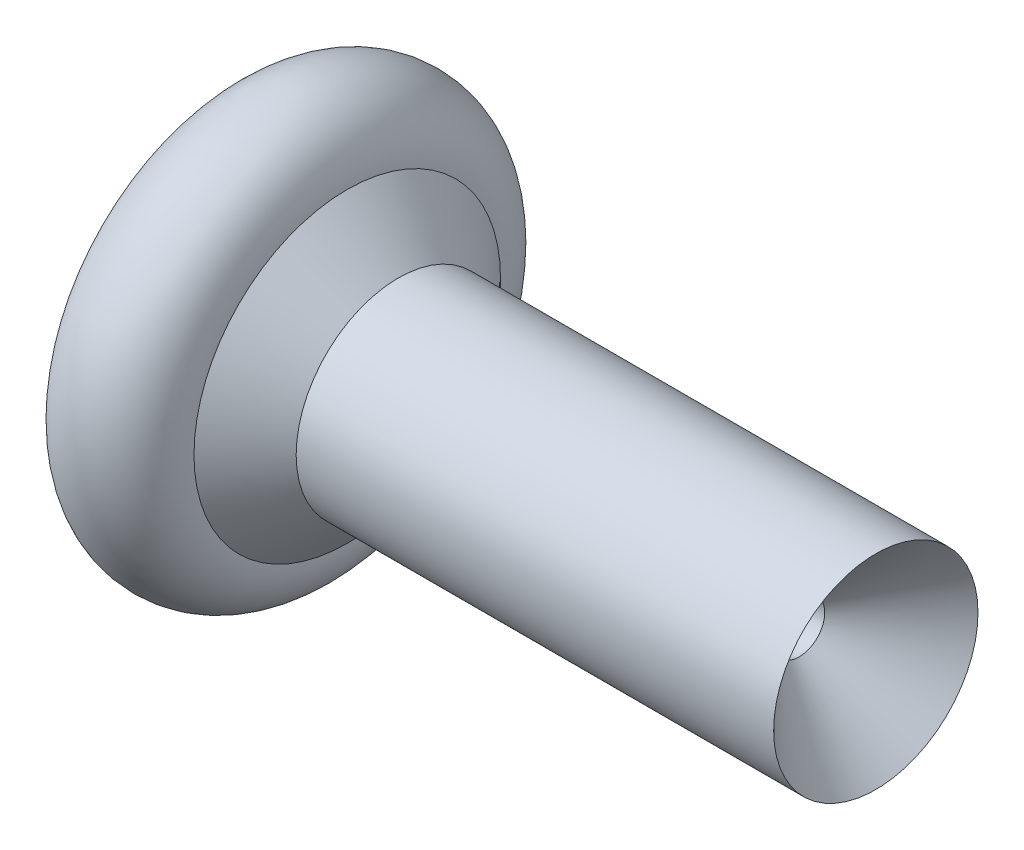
ISO-10303-21;
HEADER;
FILE_DESCRIPTION(('STEP AP214'),'2;1');
FILE_NAME('part.step','',(''),(''),'','','');
FILE_SCHEMA(('AUTOMOTIVE_DESIGN { 1 0 10303 214 1 1 1 1 }'));
ENDSEC;
DATA;
#1=APPLICATION_CONTEXT('core data for automotive mechanical design processes');
#2=APPLICATION_PROTOCOL_DEFINITION('international standard','automotive_design',2000,#1);
#3=PRODUCT_CONTEXT('',#1,'mechanical');
#4=PRODUCT('Part','Part','',(#3));
#5=PRODUCT_RELATED_PRODUCT_CATEGORY('part','',(#4));
#6=PRODUCT_DEFINITION_FORMATION('','',#4);
#7=PRODUCT_DEFINITION_CONTEXT('part definition',#1,'design');
#8=PRODUCT_DEFINITION('design','',#6,#7);
#9=PRODUCT_DEFINITION_SHAPE('','',#8);
#10=(LENGTH_UNIT() NAMED_UNIT(*) SI_UNIT(.MILLI.,.METRE.));
#11=(NAMED_UNIT(*) PLANE_ANGLE_UNIT() SI_UNIT($,.RADIAN.));
#12=(NAMED_UNIT(*) SI_UNIT($,.STERADIAN.) SOLID_ANGLE_UNIT());
#13=UNCERTAINTY_MEASURE_WITH_UNIT(LENGTH_MEASURE(1.E-05),#10,'distance_accuracy_value','');
#14=(GEOMETRIC_REPRESENTATION_CONTEXT(3) GLOBAL_UNCERTAINTY_ASSIGNED_CONTEXT((#13)) GLOBAL_UNIT_ASSIGNED_CONTEXT((#10,
#11,#12)) REPRESENTATION_CONTEXT('',''));
#15=CARTESIAN_POINT('',(0.,0.,0.));
#16=DIRECTION('',(0.,0.,1.));
#17=DIRECTION('',(1.,0.,0.));
#18=AXIS2_PLACEMENT_3D('',#15,#16,#17);
#19=CARTESIAN_POINT('',(0.,0.,0.));
#20=DIRECTION('',(-1.,0.,0.));
#21=DIRECTION('',(0.,0.,1.));
#22=AXIS2_PLACEMENT_3D('',#19,#20,#21);
#23=CYLINDRICAL_SURFACE('',#22,5.);
#24=CARTESIAN_POINT('',(112.474774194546,0.,0.));
#25=DIRECTION('',(-1.,0.,0.));
#26=DIRECTION('',(0.,0.,1.));
#27=AXIS2_PLACEMENT_3D('',#24,#25,#26);
#28=CIRCLE('',#27,5.);
#29=CARTESIAN_POINT('',(112.474774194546,0.,-5.00000000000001));
#30=VERTEX_POINT('',#29);
#31=EDGE_CURVE('E76',#30,#30,#28,.T.);
#32=ORIENTED_EDGE('',*,*,#31,.F.);
#33=EDGE_LOOP('',(#32));
#34=FACE_BOUND('',#33,.T.);
#35=CARTESIAN_POINT('',(82.4747741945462,0.,0.));
#36=DIRECTION('',(-1.,0.,0.));
#37=DIRECTION('',(0.,0.,1.));
#38=AXIS2_PLACEMENT_3D('',#35,#36,#37);
#39=CIRCLE('',#38,5.);
#40=CARTESIAN_POINT('',(82.4747741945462,0.,5.));
#41=VERTEX_POINT('',#40);
#42=EDGE_CURVE('E11',#41,#41,#39,.T.);
#43=ORIENTED_EDGE('',*,*,#42,.T.);
#44=EDGE_LOOP('',(#43));
#45=FACE_BOUND('',#44,.T.);
#46=ADVANCED_FACE('F33',(#34,#45),#23,.F.);
#47=CARTESIAN_POINT('',(82.4747741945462,0.,0.));
#48=DIRECTION('',(-1.,0.,0.));
#49=DIRECTION('',(0.,0.,1.));
#50=AXIS2_PLACEMENT_3D('',#47,#48,#49);
#51=PLANE('',#50);
#52=ORIENTED_EDGE('',*,*,#42,.F.);
#53=EDGE_LOOP('',(#52));
#54=FACE_BOUND('',#53,.T.);
#55=ADVANCED_FACE('F46',(#54),#51,.F.);
#56=CARTESIAN_POINT('',(35.,0.,0.));
#57=DIRECTION('',(-1.,0.,0.));
#58=DIRECTION('',(0.,0.,1.));
#59=AXIS2_PLACEMENT_3D('',#56,#57,#58);
#60=CONICAL_SURFACE('',#59,10.,0.349065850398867);
#61=CARTESIAN_POINT('',(62.4747741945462,0.,0.));
#62=VERTEX_POINT('',#61);
#63=VERTEX_LOOP('',#62);
#64=FACE_BOUND('',#63,.T.);
#65=CARTESIAN_POINT('',(35.,0.,0.));
#66=DIRECTION('',(-1.,0.,0.));
#67=DIRECTION('',(0.,0.,1.));
#68=AXIS2_PLACEMENT_3D('',#65,#66,#67);
#69=CIRCLE('',#68,10.);
#70=CARTESIAN_POINT('',(35.,0.,10.));
#71=VERTEX_POINT('',#70);
#72=EDGE_CURVE('E39',#71,#71,#69,.T.);
#73=ORIENTED_EDGE('',*,*,#72,.T.);
#74=EDGE_LOOP('',(#73));
#75=FACE_BOUND('',#74,.T.);
#76=ADVANCED_FACE('F42',(#64,#75),#60,.F.);
#77=CARTESIAN_POINT('',(35.,0.,-5.));
#78=DIRECTION('',(-1.,0.,0.));
#79=DIRECTION('',(0.,0.,1.));
#80=AXIS2_PLACEMENT_3D('',#77,#78,#79);
#81=PLANE('',#80);
#82=ORIENTED_EDGE('',*,*,#72,.F.);
#83=EDGE_LOOP('',(#82));
#84=FACE_BOUND('',#83,.T.);
#85=CARTESIAN_POINT('',(35.,0.,0.));
#86=DIRECTION('',(-1.,0.,0.));
#87=DIRECTION('',(0.,0.,1.));
#88=AXIS2_PLACEMENT_3D('',#85,#86,#87);
#89=CIRCLE('',#88,5.);
#90=CARTESIAN_POINT('',(35.,0.,5.));
#91=VERTEX_POINT('',#90);
#92=EDGE_CURVE('E51',#91,#91,#89,.T.);
#93=ORIENTED_EDGE('',*,*,#92,.T.);
#94=EDGE_LOOP('',(#93));
#95=FACE_BOUND('',#94,.T.);
#96=ADVANCED_FACE('F45',(#84,#95),#81,.F.);
#97=CARTESIAN_POINT('',(0.,0.,0.));
#98=DIRECTION('',(-1.,0.,0.));
#99=DIRECTION('',(0.,0.,1.));
#100=AXIS2_PLACEMENT_3D('',#97,#98,#99);
#101=CYLINDRICAL_SURFACE('',#100,5.);
#102=ORIENTED_EDGE('',*,*,#92,.F.);
#103=EDGE_LOOP('',(#102));
#104=FACE_BOUND('',#103,.T.);
#105=CARTESIAN_POINT('',(20.,0.,0.));
#106=DIRECTION('',(-1.,0.,0.));
#107=DIRECTION('',(0.,0.,1.));
#108=AXIS2_PLACEMENT_3D('',#105,#106,#107);
#109=CIRCLE('',#108,5.);
#110=CARTESIAN_POINT('',(20.,0.,5.));
#111=VERTEX_POINT('',#110);
#112=EDGE_CURVE('E53',#111,#111,#109,.T.);
#113=ORIENTED_EDGE('',*,*,#112,.T.);
#114=EDGE_LOOP('',(#113));
#115=FACE_BOUND('',#114,.T.);
#116=ADVANCED_FACE('F92',(#104,#115),#101,.F.);
#117=CARTESIAN_POINT('',(20.,0.,-15.));
#118=DIRECTION('',(1.,0.,0.));
#119=DIRECTION('',(0.,0.,-1.));
#120=AXIS2_PLACEMENT_3D('',#117,#118,#119);
#121=PLANE('',#120);
#122=ORIENTED_EDGE('',*,*,#112,.F.);
#123=EDGE_LOOP('',(#122));
#124=FACE_BOUND('',#123,.T.);
#125=CARTESIAN_POINT('',(20.,0.,0.));
#126=DIRECTION('',(-1.,0.,0.));
#127=DIRECTION('',(0.,0.,1.));
#128=AXIS2_PLACEMENT_3D('',#125,#126,#127);
#129=CIRCLE('',#128,15.);
#130=CARTESIAN_POINT('',(20.,0.,15.));
#131=VERTEX_POINT('',#130);
#132=EDGE_CURVE('E58',#131,#131,#129,.T.);
#133=ORIENTED_EDGE('',*,*,#132,.T.);
#134=EDGE_LOOP('',(#133));
#135=FACE_BOUND('',#134,.T.);
#136=ADVANCED_FACE('F95',(#124,#135),#121,.F.);
#137=CARTESIAN_POINT('',(0.,0.,0.));
#138=DIRECTION('',(-1.,0.,0.));
#139=DIRECTION('',(0.,0.,1.));
#140=AXIS2_PLACEMENT_3D('',#137,#138,#139);
#141=CYLINDRICAL_SURFACE('',#140,15.);
#142=ORIENTED_EDGE('',*,*,#132,.F.);
#143=EDGE_LOOP('',(#142));
#144=FACE_BOUND('',#143,.T.);
#145=CARTESIAN_POINT('',(0.,0.,0.));
#146=DIRECTION('',(-1.,0.,0.));
#147=DIRECTION('',(0.,0.,1.));
#148=AXIS2_PLACEMENT_3D('',#145,#146,#147);
#149=CIRCLE('',#148,15.);
#150=CARTESIAN_POINT('',(0.,0.,15.));
#151=VERTEX_POINT('',#150);
#152=EDGE_CURVE('E61',#151,#151,#149,.T.);
#153=ORIENTED_EDGE('',*,*,#152,.T.);
#154=EDGE_LOOP('',(#153));
#155=FACE_BOUND('',#154,.T.);
#156=ADVANCED_FACE('F99',(#144,#155),#141,.F.);
#157=CARTESIAN_POINT('',(0.,0.,-15.));
#158=DIRECTION('',(1.,0.,0.));
#159=DIRECTION('',(0.,0.,-1.));
#160=AXIS2_PLACEMENT_3D('',#157,#158,#159);
#161=PLANE('',#160);
#162=ORIENTED_EDGE('',*,*,#152,.F.);
#163=EDGE_LOOP('',(#162));
#164=FACE_BOUND('',#163,.T.);
#165=CARTESIAN_POINT('',(0.,0.,0.));
#166=DIRECTION('',(-1.,0.,0.));
#167=DIRECTION('',(0.,0.,1.));
#168=AXIS2_PLACEMENT_3D('',#165,#166,#167);
#169=CIRCLE('',#168,30.);
#170=CARTESIAN_POINT('',(0.,0.,30.));
#171=VERTEX_POINT('',#170);
#172=EDGE_CURVE('E64',#171,#171,#169,.T.);
#173=ORIENTED_EDGE('',*,*,#172,.T.);
#174=EDGE_LOOP('',(#173));
#175=FACE_BOUND('',#174,.T.);
#176=ADVANCED_FACE('F103',(#164,#175),#161,.F.);
#177=CARTESIAN_POINT('',(12.,0.,0.));
#178=DIRECTION('',(-1.,0.,0.));
#179=DIRECTION('',(0.,0.,1.));
#180=AXIS2_PLACEMENT_3D('',#177,#178,#179);
#181=TOROIDAL_SURFACE('',#180,30.,12.);
#182=ORIENTED_EDGE('',*,*,#172,.F.);
#183=EDGE_LOOP('',(#182));
#184=FACE_BOUND('',#183,.T.);
#185=CARTESIAN_POINT('',(24.,0.,0.));
#186=DIRECTION('',(-1.,0.,0.));
#187=DIRECTION('',(0.,0.,1.));
#188=AXIS2_PLACEMENT_3D('',#185,#186,#187);
#189=CIRCLE('',#188,30.);
#190=CARTESIAN_POINT('',(24.,0.,30.));
#191=VERTEX_POINT('',#190);
#192=EDGE_CURVE('E67',#191,#191,#189,.T.);
#193=ORIENTED_EDGE('',*,*,#192,.T.);
#194=EDGE_LOOP('',(#193));
#195=FACE_BOUND('',#194,.T.);
#196=ADVANCED_FACE('F107',(#184,#195),#181,.T.);
#197=CARTESIAN_POINT('',(34.,0.,0.));
#198=DIRECTION('',(-1.,0.,0.));
#199=DIRECTION('',(0.,0.,1.));
#200=AXIS2_PLACEMENT_3D('',#197,#198,#199);
#201=CONICAL_SURFACE('',#200,20.,0.78539816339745);
#202=ORIENTED_EDGE('',*,*,#192,.F.);
#203=EDGE_LOOP('',(#202));
#204=FACE_BOUND('',#203,.T.);
#205=CARTESIAN_POINT('',(34.,0.,0.));
#206=DIRECTION('',(-1.,0.,0.));
#207=DIRECTION('',(0.,0.,1.));
#208=AXIS2_PLACEMENT_3D('',#205,#206,#207);
#209=CIRCLE('',#208,20.);
#210=CARTESIAN_POINT('',(34.,0.,20.));
#211=VERTEX_POINT('',#210);
#212=EDGE_CURVE('E70',#211,#211,#209,.T.);
#213=ORIENTED_EDGE('',*,*,#212,.T.);
#214=EDGE_LOOP('',(#213));
#215=FACE_BOUND('',#214,.T.);
#216=ADVANCED_FACE('F111',(#204,#215),#201,.T.);
#217=CARTESIAN_POINT('',(0.,0.,0.));
#218=DIRECTION('',(-1.,0.,0.));
#219=DIRECTION('',(0.,0.,1.));
#220=AXIS2_PLACEMENT_3D('',#217,#218,#219);
#221=CYLINDRICAL_SURFACE('',#220,20.);
#222=ORIENTED_EDGE('',*,*,#212,.F.);
#223=EDGE_LOOP('',(#222));
#224=FACE_BOUND('',#223,.T.);
#225=CARTESIAN_POINT('',(127.474774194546,0.,0.));
#226=DIRECTION('',(-1.,0.,0.));
#227=DIRECTION('',(0.,0.,1.));
#228=AXIS2_PLACEMENT_3D('',#225,#226,#227);
#229=CIRCLE('',#228,20.);
#230=CARTESIAN_POINT('',(127.474774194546,0.,-20.));
#231=VERTEX_POINT('',#230);
#232=EDGE_CURVE('E73',#231,#231,#229,.T.);
#233=ORIENTED_EDGE('',*,*,#232,.T.);
#234=EDGE_LOOP('',(#233));
#235=FACE_BOUND('',#234,.T.);
#236=ADVANCED_FACE('F115',(#224,#235),#221,.T.);
#237=CARTESIAN_POINT('',(112.474774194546,0.,0.));
#238=DIRECTION('',(1.,0.,0.));
#239=DIRECTION('',(0.,0.,-1.));
#240=AXIS2_PLACEMENT_3D('',#237,#238,#239);
#241=CONICAL_SURFACE('',#240,5.,0.785398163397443);
#242=CARTESIAN_POINT('',(127.474774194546,0.,-20.));
#243=CARTESIAN_POINT('',(127.318524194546,0.,-19.84375));
#244=CARTESIAN_POINT('',(127.162274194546,0.,-19.6875));
#245=CARTESIAN_POINT('',(126.849774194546,0.,-19.375));
#246=CARTESIAN_POINT('',(126.693524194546,0.,-19.21875));
#247=CARTESIAN_POINT('',(126.381024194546,0.,-18.90625));
#248=CARTESIAN_POINT('',(126.224774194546,0.,-18.75));
#249=CARTESIAN_POINT('',(125.912274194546,0.,-18.4375));
#250=CARTESIAN_POINT('',(125.756024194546,0.,-18.28125));
#251=CARTESIAN_POINT('',(125.443524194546,0.,-17.96875));
#252=CARTESIAN_POINT('',(125.287274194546,0.,-17.8125));
#253=CARTESIAN_POINT('',(124.974774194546,0.,-17.5));
#254=CARTESIAN_POINT('',(124.818524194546,0.,-17.34375));
#255=CARTESIAN_POINT('',(124.506024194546,0.,-17.03125));
#256=CARTESIAN_POINT('',(124.349774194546,0.,-16.875));
#257=CARTESIAN_POINT('',(124.037274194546,0.,-16.5625));
#258=CARTESIAN_POINT('',(123.881024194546,0.,-16.40625));
#259=CARTESIAN_POINT('',(123.568524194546,0.,-16.09375));
#260=CARTESIAN_POINT('',(123.412274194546,0.,-15.9375));
#261=CARTESIAN_POINT('',(123.099774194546,0.,-15.625));
#262=CARTESIAN_POINT('',(122.943524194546,0.,-15.46875));
#263=CARTESIAN_POINT('',(122.631024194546,0.,-15.15625));
#264=CARTESIAN_POINT('',(122.474774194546,0.,-15.));
#265=CARTESIAN_POINT('',(122.162274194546,0.,-14.6875));
#266=CARTESIAN_POINT('',(122.006024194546,0.,-14.53125));
#267=CARTESIAN_POINT('',(121.693524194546,0.,-14.21875));
#268=CARTESIAN_POINT('',(121.537274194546,0.,-14.0625));
#269=CARTESIAN_POINT('',(121.224774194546,0.,-13.75));
#270=CARTESIAN_POINT('',(121.068524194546,0.,-13.59375));
#271=CARTESIAN_POINT('',(120.756024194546,0.,-13.28125));
#272=CARTESIAN_POINT('',(120.599774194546,0.,-13.125));
#273=CARTESIAN_POINT('',(120.287274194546,0.,-12.8125));
#274=CARTESIAN_POINT('',(120.131024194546,0.,-12.65625));
#275=CARTESIAN_POINT('',(119.818524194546,0.,-12.34375));
#276=CARTESIAN_POINT('',(119.662274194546,0.,-12.1875));
#277=CARTESIAN_POINT('',(119.349774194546,0.,-11.875));
#278=CARTESIAN_POINT('',(119.193524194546,0.,-11.71875));
#279=CARTESIAN_POINT('',(118.881024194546,0.,-11.40625));
#280=CARTESIAN_POINT('',(118.724774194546,0.,-11.25));
#281=CARTESIAN_POINT('',(118.412274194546,0.,-10.9375));
#282=CARTESIAN_POINT('',(118.256024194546,0.,-10.78125));
#283=CARTESIAN_POINT('',(117.943524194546,0.,-10.46875));
#284=CARTESIAN_POINT('',(117.787274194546,0.,-10.3125));
#285=CARTESIAN_POINT('',(117.474774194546,0.,-10.));
#286=CARTESIAN_POINT('',(117.318524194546,0.,-9.84375000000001));
#287=CARTESIAN_POINT('',(117.006024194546,0.,-9.53125000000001));
#288=CARTESIAN_POINT('',(116.849774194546,0.,-9.37500000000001));
#289=CARTESIAN_POINT('',(116.537274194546,0.,-9.06250000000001));
#290=CARTESIAN_POINT('',(116.381024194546,0.,-8.90625));
#291=CARTESIAN_POINT('',(116.068524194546,0.,-8.59375));
#292=CARTESIAN_POINT('',(115.912274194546,0.,-8.4375));
#293=CARTESIAN_POINT('',(115.599774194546,0.,-8.12500000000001));
#294=CARTESIAN_POINT('',(115.443524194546,0.,-7.96875000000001));
#295=CARTESIAN_POINT('',(115.131024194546,0.,-7.65625000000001));
#296=CARTESIAN_POINT('',(114.974774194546,0.,-7.50000000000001));
#297=CARTESIAN_POINT('',(114.662274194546,0.,-7.18750000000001));
#298=CARTESIAN_POINT('',(114.506024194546,0.,-7.03125000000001));
#299=CARTESIAN_POINT('',(114.193524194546,0.,-6.71875000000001));
#300=CARTESIAN_POINT('',(114.037274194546,0.,-6.56250000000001));
#301=CARTESIAN_POINT('',(113.724774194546,0.,-6.25000000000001));
#302=CARTESIAN_POINT('',(113.568524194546,0.,-6.09375000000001));
#303=CARTESIAN_POINT('',(113.256024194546,0.,-5.78125000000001));
#304=CARTESIAN_POINT('',(113.099774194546,0.,-5.62500000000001));
#305=CARTESIAN_POINT('',(112.787274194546,0.,-5.31250000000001));
#306=CARTESIAN_POINT('',(112.631024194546,0.,-5.15625000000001));
#307=CARTESIAN_POINT('',(112.474774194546,0.,-5.00000000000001));
#308=B_SPLINE_CURVE_WITH_KNOTS('',3,(#242,#243,#244,#245,#246,#247,#248,#249,#250,#251,#252,
#253,#254,#255,#256,#257,#258,#259,#260,#261,#262,#263,#264,#265,#266,#267,#268,#269,#270,#271,
#272,#273,#274,#275,#276,#277,#278,#279,#280,#281,#282,#283,#284,#285,#286,#287,#288,#289,#290,
#291,#292,#293,#294,#295,#296,#297,#298,#299,#300,#301,#302,#303,#304,#305,#306,#307),
.UNSPECIFIED.,.F.,.F.,(4,2,2,2,2,2,2,2,2,2,2,2,2,2,2,2,2,2,2,2,2,2,2,2,2,2,2,2,2,2,2,2,4),(0.,
0.662912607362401,1.3258252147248,1.98873782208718,2.65165042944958,3.31456303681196,
3.97747564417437,4.64038825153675,5.30330085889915,5.96621346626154,6.62912607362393,
7.29203868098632,7.95495128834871,8.6178638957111,9.28077650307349,9.94368911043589,
10.6066017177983,11.2695143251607,11.9324269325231,12.5953395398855,13.2582521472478,
13.9211647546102,14.5840773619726,15.246989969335,15.9099025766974,16.5728151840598,
17.2357277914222,17.8986403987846,18.561553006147,19.2244656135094,19.8873782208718,
20.5502908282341,21.2132034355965),.UNSPECIFIED.);
#309=EDGE_CURVE('BSEAM80',#231,#30,#308,.T.);
#310=ORIENTED_EDGE('',*,*,#232,.F.);
#311=ORIENTED_EDGE('',*,*,#31,.T.);
#312=ORIENTED_EDGE('',*,*,#309,.T.);
#313=ORIENTED_EDGE('',*,*,#309,.F.);
#314=EDGE_LOOP('',(#310,#312,#311,#313));
#315=FACE_BOUND('',#314,.T.);
#316=ADVANCED_FACE('F80',(#315),#241,.F.);
#317=CLOSED_SHELL('',(#46,#55,#76,#96,#116,#136,#156,#176,#196,#216,#236,#316));
#318=MANIFOLD_SOLID_BREP('B2',#317);
#319=ADVANCED_BREP_SHAPE_REPRESENTATION('',(#18,#318),#14);
#320=SHAPE_DEFINITION_REPRESENTATION(#9,#319);
ENDSEC;
END-ISO-10303-21;
